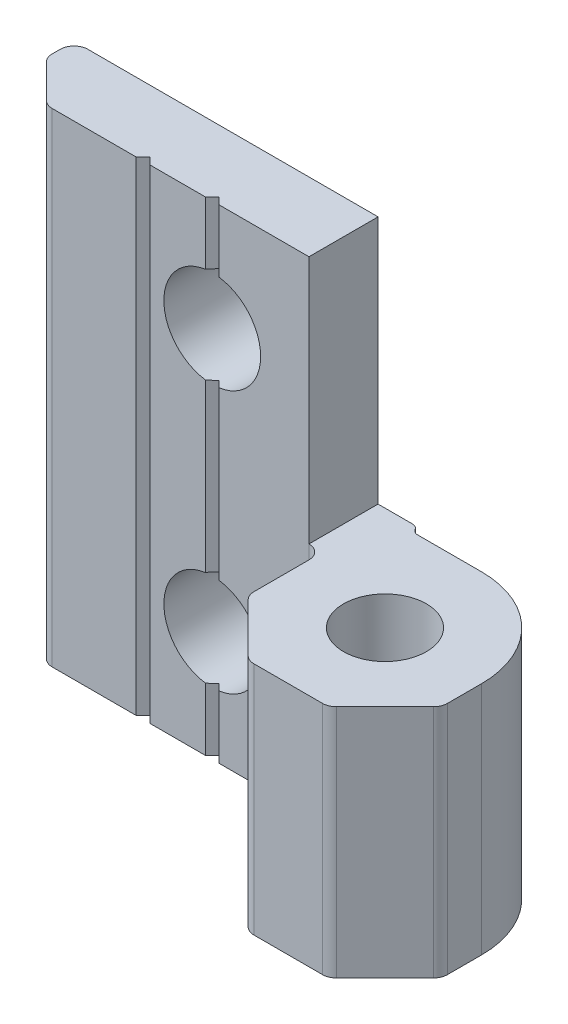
from build123d import *

# Parameters (mm, degrees)
SKETCH_1_R                = 3
EXTRUDE_1_DEPTH           = 35
SKETCH_2_W                = 25.824194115
SKETCH_2_H                = 24.915128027
CUT_EXTRUDE_1_DEPTH       = 35
HOLE_WIZARD_7_0_7_1_D     = 7
HOLE_WIZARD_7_0_7_1_DEPTH = 30
HOLE_WIZARD_7_0_7_1_TIP   = 2.103012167


with BuildPart() as part:
    # Sketch 1 → Extrude 1 (new body)
    with BuildSketch(Plane(origin=(0, 0, 0), x_dir=(1, 0, 0), z_dir=(0, 1, 0))):
        with BuildLine():
            Line((-30, 5.914213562), (-30, 6.5))
            ThreePointArc((-30, 6.5), (-29.707106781, 7.207106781), (-29, 7.5))
            Line((-29, 7.5), (-5.5, 7.5))
            ThreePointArc((-5.5, 7.5), (-5.25, 7.433012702), (-5.066987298, 7.25))
            ThreePointArc((-5.066987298, 7.25), (-4.883974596, 7.066987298), (-4.633974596, 7))
            Line((-4.633974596, 7), (0, 7))
            ThreePointArc((0, 7), (4.949747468, 4.949747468), (7, 0))
            Line((7, 0), (7, -2.485281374))
            ThreePointArc((7, -2.485281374), (6.923879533, -2.867964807), (6.707106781, -3.192388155))
            Line((6.707106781, -3.192388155), (3.192388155, -6.707106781))
            ThreePointArc((3.192388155, -6.707106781), (2.867964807, -6.923879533), (2.485281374, -7))
            Line((2.485281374, -7), (-2.485281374, -7))
            ThreePointArc((-2.485281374, -7), (-2.867964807, -6.923879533), (-3.192388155, -6.707106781))
            Line((-3.192388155, -6.707106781), (-6.707106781, -3.192388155))
            ThreePointArc((-6.707106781, -3.192388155), (-6.923879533, -2.867964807), (-7, -2.485281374))
            Line((-7, -2.485281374), (-7, 1.5))
            ThreePointArc((-7, 1.5), (-7.292893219, 2.207106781), (-8, 2.5))
            Line((-8, 2.5), (-14.5, 2.5))
            Line((-14.5, 2.5), (-15, 3))
            Line((-15, 3), (-15.5, 2.5))
            Line((-15.5, 2.5), (-19.5, 2.5))
            Line((-19.5, 2.5), (-20, 3))
            Line((-20, 3), (-20.5, 2.5))
            Line((-20.5, 2.5), (-26.585786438, 2.5))
            ThreePointArc((-26.585786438, 2.5), (-26.96846987, 2.576120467), (-27.292893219, 2.792893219))
            Line((-27.292893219, 2.792893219), (-29.707106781, 5.207106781))
            ThreePointArc((-29.707106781, 5.207106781), (-29.923879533, 5.53153013), (-30, 5.914213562))
        make_face()
        with Locations(Location((0, 0, 0), (0, 0, 270))):
            Circle(SKETCH_1_R, mode=Mode.SUBTRACT)
    extrude(amount=EXTRUDE_1_DEPTH)

    # Sketch 2 → Cut-Extrude 1 (cut)
    with BuildSketch(Plane(origin=(0, 0, -7.5), x_dir=(-1, 0, 0), z_dir=(0, 0, -1))):
        with Locations((-4.912097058, 29.457564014)):
            Rectangle(SKETCH_2_W, SKETCH_2_H)
    extrude(amount=-CUT_EXTRUDE_1_DEPTH, mode=Mode.SUBTRACT)

    # Hole Wizard 7.0 _7_ _1
    with Locations(Plane(origin=(-15, 27, -2.5), x_dir=(1, 0, 0), z_dir=(0, 0, 1))):
        with Locations((0, 0), (0, -19)):
            Hole(HOLE_WIZARD_7_0_7_1_D / 2, depth=HOLE_WIZARD_7_0_7_1_DEPTH)
            with Locations((0, 0, -(HOLE_WIZARD_7_0_7_1_DEPTH + HOLE_WIZARD_7_0_7_1_TIP / 2))):  # 118° drill point
                Cone(0, HOLE_WIZARD_7_0_7_1_D / 2, HOLE_WIZARD_7_0_7_1_TIP, mode=Mode.SUBTRACT)


solid = part.part
